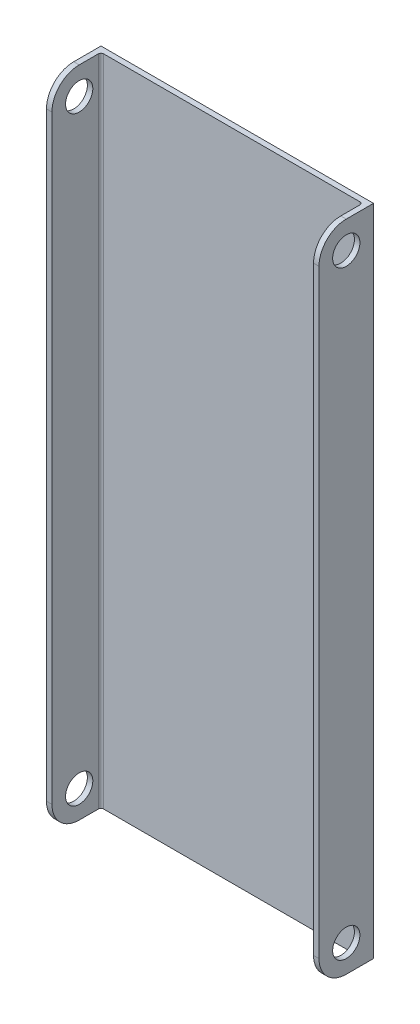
from build123d import *

# Parameters (mm, degrees)
SKETCH3_W           = 63.5
SKETCH3_H           = 152.4
BOSS_EXTRUDE1_DEPTH = 1.27
SKETCH4_W           = 12.7
SKETCH4_H           = 152.4
SKETCH4_R           = 3.175
BOSS_EXTRUDE2_DEPTH = 1.27
FILLET1_R           = 6.35
FILLET3_R           = 0.635


with BuildPart() as part:
    # Sketch3 → Boss-Extrude1 (new body)
    with BuildSketch(Plane.XY):
        with Locations((-31.75, 76.2)):
            Rectangle(SKETCH3_W, SKETCH3_H)
    extrude(amount=BOSS_EXTRUDE1_DEPTH)

    # Sketch4 → Boss-Extrude2 (add)
    with BuildSketch(Plane(origin=(0, 0, 0), x_dir=(0, 0, -1), z_dir=(1, 0, 0))):
        with Locations((-6.35, 76.2)):
            Rectangle(SKETCH4_W, SKETCH4_H)
        with Locations((-6.35, 6.35)):
            Circle(SKETCH4_R, mode=Mode.SUBTRACT)
        with Locations((-6.35, 146.05)):
            Circle(SKETCH4_R, mode=Mode.SUBTRACT)
    boss_extrude2 = extrude(amount=-BOSS_EXTRUDE2_DEPTH)

    # Mirror3: Boss-Extrude2 across plane
    add(boss_extrude2.mirror(Plane(origin=(-31.75, 0, 0), x_dir=(0, 0, 1), z_dir=(1, 0, 0))))

    # Fillet1
    fillet1_edges = [part.edges().sort_by_distance(p)[0] for p in [
        (-0.635, 0, 12.7),
        (-0.635, 152.4, 12.7),
        (-62.865, 152.4, 12.7),
        (-62.865, 0, 12.7),
    ]]
    fillet(fillet1_edges, radius=FILLET1_R)

    # Fillet3
    fillet3_edges = [part.edges().sort_by_distance(p)[0] for p in [
        (-1.27, 76.2, 1.27),
        (-62.23, 76.2, 1.27),
    ]]
    fillet(fillet3_edges, radius=FILLET3_R)


solid = part.part
